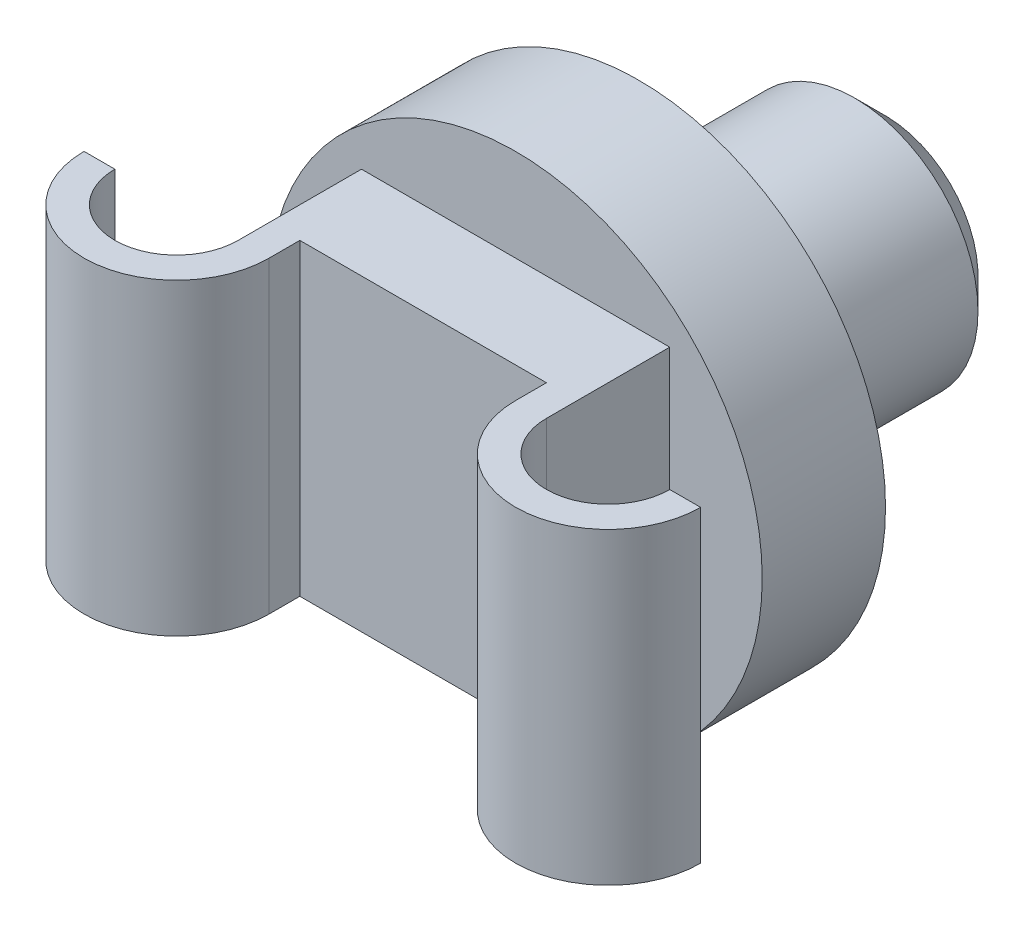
ISO-10303-21;
HEADER;
FILE_DESCRIPTION(('STEP AP214'),'2;1');
FILE_NAME('part.step','',(''),(''),'','','');
FILE_SCHEMA(('AUTOMOTIVE_DESIGN { 1 0 10303 214 1 1 1 1 }'));
ENDSEC;
DATA;
#1=APPLICATION_CONTEXT('core data for automotive mechanical design processes');
#2=APPLICATION_PROTOCOL_DEFINITION('international standard','automotive_design',2000,#1);
#3=PRODUCT_CONTEXT('',#1,'mechanical');
#4=PRODUCT('Part','Part','',(#3));
#5=PRODUCT_RELATED_PRODUCT_CATEGORY('part','',(#4));
#6=PRODUCT_DEFINITION_FORMATION('','',#4);
#7=PRODUCT_DEFINITION_CONTEXT('part definition',#1,'design');
#8=PRODUCT_DEFINITION('design','',#6,#7);
#9=PRODUCT_DEFINITION_SHAPE('','',#8);
#10=(LENGTH_UNIT() NAMED_UNIT(*) SI_UNIT(.MILLI.,.METRE.));
#11=(NAMED_UNIT(*) PLANE_ANGLE_UNIT() SI_UNIT($,.RADIAN.));
#12=(NAMED_UNIT(*) SI_UNIT($,.STERADIAN.) SOLID_ANGLE_UNIT());
#13=UNCERTAINTY_MEASURE_WITH_UNIT(LENGTH_MEASURE(1.E-05),#10,'distance_accuracy_value','');
#14=(GEOMETRIC_REPRESENTATION_CONTEXT(3) GLOBAL_UNCERTAINTY_ASSIGNED_CONTEXT((#13)) GLOBAL_UNIT_ASSIGNED_CONTEXT((#10,
#11,#12)) REPRESENTATION_CONTEXT('',''));
#15=CARTESIAN_POINT('',(0.,0.,0.));
#16=DIRECTION('',(0.,0.,1.));
#17=DIRECTION('',(1.,0.,0.));
#18=AXIS2_PLACEMENT_3D('',#15,#16,#17);
#19=CARTESIAN_POINT('',(0.,0.,0.));
#20=DIRECTION('',(0.,0.,1.));
#21=DIRECTION('',(1.,0.,0.));
#22=AXIS2_PLACEMENT_3D('',#19,#20,#21);
#23=PLANE('',#22);
#24=CARTESIAN_POINT('',(0.,0.,0.));
#25=DIRECTION('',(0.,0.,1.));
#26=DIRECTION('',(1.,0.,0.));
#27=AXIS2_PLACEMENT_3D('',#24,#25,#26);
#28=CIRCLE('',#27,4.);
#29=CARTESIAN_POINT('',(4.,0.,0.));
#30=VERTEX_POINT('',#29);
#31=EDGE_CURVE('E215',#30,#30,#28,.T.);
#32=ORIENTED_EDGE('',*,*,#31,.F.);
#33=EDGE_LOOP('',(#32));
#34=FACE_BOUND('',#33,.T.);
#35=CARTESIAN_POINT('',(0.,0.,0.));
#36=DIRECTION('',(0.,0.,1.));
#37=DIRECTION('',(1.,0.,0.));
#38=AXIS2_PLACEMENT_3D('',#35,#36,#37);
#39=CIRCLE('',#38,2.);
#40=CARTESIAN_POINT('',(2.,0.,0.));
#41=VERTEX_POINT('',#40);
#42=EDGE_CURVE('E229',#41,#41,#39,.F.);
#43=ORIENTED_EDGE('',*,*,#42,.F.);
#44=EDGE_LOOP('',(#43));
#45=FACE_BOUND('',#44,.T.);
#46=ADVANCED_FACE('F32',(#34,#45),#23,.F.);
#47=CARTESIAN_POINT('',(0.,0.,2.));
#48=DIRECTION('',(0.,0.,1.));
#49=DIRECTION('',(1.,0.,0.));
#50=AXIS2_PLACEMENT_3D('',#47,#48,#49);
#51=PLANE('',#50);
#52=CARTESIAN_POINT('',(0.,0.,2.));
#53=DIRECTION('',(0.,0.,1.));
#54=DIRECTION('',(1.,0.,0.));
#55=AXIS2_PLACEMENT_3D('',#52,#53,#54);
#56=CIRCLE('',#55,4.);
#57=CARTESIAN_POINT('',(4.,0.,2.));
#58=VERTEX_POINT('',#57);
#59=EDGE_CURVE('E218',#58,#58,#56,.T.);
#60=ORIENTED_EDGE('',*,*,#59,.T.);
#61=EDGE_LOOP('',(#60));
#62=FACE_BOUND('',#61,.T.);
#63=DIRECTION('',(1.,0.,0.));
#64=VECTOR('',#63,1.);
#65=CARTESIAN_POINT('',(-2.5,-2.5,2.));
#66=LINE('',#65,#64);
#67=CARTESIAN_POINT('',(-2.5,-2.5,2.));
#68=VERTEX_POINT('',#67);
#69=CARTESIAN_POINT('',(2.5,-2.5,2.));
#70=VERTEX_POINT('',#69);
#71=EDGE_CURVE('E198',#68,#70,#66,.T.);
#72=ORIENTED_EDGE('',*,*,#71,.F.);
#73=DIRECTION('',(0.,-1.,0.));
#74=VECTOR('',#73,1.);
#75=CARTESIAN_POINT('',(-2.5,2.5,2.));
#76=LINE('',#75,#74);
#77=CARTESIAN_POINT('',(-2.5,2.5,2.));
#78=VERTEX_POINT('',#77);
#79=EDGE_CURVE('E195',#78,#68,#76,.T.);
#80=ORIENTED_EDGE('',*,*,#79,.F.);
#81=DIRECTION('',(-1.,0.,0.));
#82=VECTOR('',#81,1.);
#83=CARTESIAN_POINT('',(-2.5,2.5,2.));
#84=LINE('',#83,#82);
#85=CARTESIAN_POINT('',(2.5,2.5,2.));
#86=VERTEX_POINT('',#85);
#87=EDGE_CURVE('E52',#86,#78,#84,.T.);
#88=ORIENTED_EDGE('',*,*,#87,.F.);
#89=DIRECTION('',(0.,1.,0.));
#90=VECTOR('',#89,1.);
#91=CARTESIAN_POINT('',(2.5,2.5,2.));
#92=LINE('',#91,#90);
#93=EDGE_CURVE('E200',#70,#86,#92,.T.);
#94=ORIENTED_EDGE('',*,*,#93,.F.);
#95=EDGE_LOOP('',(#72,#80,#88,#94));
#96=FACE_BOUND('',#95,.T.);
#97=ADVANCED_FACE('F247',(#62,#96),#51,.T.);
#98=CARTESIAN_POINT('',(0.,0.,2.));
#99=DIRECTION('',(0.,0.,-1.));
#100=DIRECTION('',(-1.,0.,0.));
#101=AXIS2_PLACEMENT_3D('',#98,#99,#100);
#102=CYLINDRICAL_SURFACE('',#101,4.);
#103=ORIENTED_EDGE('',*,*,#59,.F.);
#104=EDGE_LOOP('',(#103));
#105=FACE_BOUND('',#104,.T.);
#106=ORIENTED_EDGE('',*,*,#31,.T.);
#107=EDGE_LOOP('',(#106));
#108=FACE_BOUND('',#107,.T.);
#109=ADVANCED_FACE('F34',(#105,#108),#102,.T.);
#110=CARTESIAN_POINT('',(-2.5,2.5,4.));
#111=DIRECTION('',(1.,0.,0.));
#112=DIRECTION('',(0.,1.,0.));
#113=AXIS2_PLACEMENT_3D('',#110,#111,#112);
#114=PLANE('',#113);
#115=ORIENTED_EDGE('',*,*,#79,.T.);
#116=DIRECTION('',(0.,0.,-1.));
#117=VECTOR('',#116,1.);
#118=CARTESIAN_POINT('',(-2.5,-2.5,4.));
#119=LINE('',#118,#117);
#120=CARTESIAN_POINT('',(-2.5,-2.5,4.));
#121=VERTEX_POINT('',#120);
#122=EDGE_CURVE('E213',#121,#68,#119,.T.);
#123=ORIENTED_EDGE('',*,*,#122,.F.);
#124=DIRECTION('',(0.,-1.,0.));
#125=VECTOR('',#124,1.);
#126=CARTESIAN_POINT('',(-2.5,2.5,4.));
#127=LINE('',#126,#125);
#128=CARTESIAN_POINT('',(-2.5,2.5,4.));
#129=VERTEX_POINT('',#128);
#130=EDGE_CURVE('E203',#129,#121,#127,.T.);
#131=ORIENTED_EDGE('',*,*,#130,.F.);
#132=DIRECTION('',(0.,0.,-1.));
#133=VECTOR('',#132,1.);
#134=CARTESIAN_POINT('',(-2.5,2.5,4.));
#135=LINE('',#134,#133);
#136=EDGE_CURVE('E207',#129,#78,#135,.T.);
#137=ORIENTED_EDGE('',*,*,#136,.T.);
#138=EDGE_LOOP('',(#115,#123,#131,#137));
#139=FACE_BOUND('',#138,.T.);
#140=ADVANCED_FACE('F257',(#139),#114,.F.);
#141=CARTESIAN_POINT('',(-2.5,-2.5,4.));
#142=DIRECTION('',(0.,1.,0.));
#143=DIRECTION('',(-1.,0.,0.));
#144=AXIS2_PLACEMENT_3D('',#141,#142,#143);
#145=PLANE('',#144);
#146=DIRECTION('',(1.,0.,0.));
#147=VECTOR('',#146,1.);
#148=CARTESIAN_POINT('',(-2.,-2.5,3.5));
#149=LINE('',#148,#147);
#150=CARTESIAN_POINT('',(-2.,-2.5,3.5));
#151=VERTEX_POINT('',#150);
#152=CARTESIAN_POINT('',(2.,-2.5,3.5));
#153=VERTEX_POINT('',#152);
#154=EDGE_CURVE('E179',#151,#153,#149,.T.);
#155=ORIENTED_EDGE('',*,*,#154,.F.);
#156=DIRECTION('',(0.,0.,-1.));
#157=VECTOR('',#156,1.);
#158=CARTESIAN_POINT('',(-2.,-2.5,4.20003697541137));
#159=LINE('',#158,#157);
#160=CARTESIAN_POINT('',(-2.,-2.5,4.));
#161=VERTEX_POINT('',#160);
#162=EDGE_CURVE('E148',#161,#151,#159,.T.);
#163=ORIENTED_EDGE('',*,*,#162,.F.);
#164=CARTESIAN_POINT('',(-3.5,-2.5,4.));
#165=DIRECTION('',(0.,1.,0.));
#166=DIRECTION('',(-1.,0.,0.));
#167=AXIS2_PLACEMENT_3D('',#164,#165,#166);
#168=CIRCLE('',#167,1.5);
#169=CARTESIAN_POINT('',(-5.,-2.5,4.));
#170=VERTEX_POINT('',#169);
#171=EDGE_CURVE('E135',#170,#161,#168,.T.);
#172=ORIENTED_EDGE('',*,*,#171,.F.);
#173=DIRECTION('',(-1.,0.,0.));
#174=VECTOR('',#173,1.);
#175=CARTESIAN_POINT('',(-4.5,-2.5,4.));
#176=LINE('',#175,#174);
#177=CARTESIAN_POINT('',(-4.5,-2.5,4.));
#178=VERTEX_POINT('',#177);
#179=EDGE_CURVE('E123',#178,#170,#176,.T.);
#180=ORIENTED_EDGE('',*,*,#179,.F.);
#181=CARTESIAN_POINT('',(-3.5,-2.5,4.));
#182=DIRECTION('',(0.,-1.,0.));
#183=DIRECTION('',(-1.,0.,0.));
#184=AXIS2_PLACEMENT_3D('',#181,#182,#183);
#185=CIRCLE('',#184,1.);
#186=EDGE_CURVE('E134',#121,#178,#185,.T.);
#187=ORIENTED_EDGE('',*,*,#186,.F.);
#188=ORIENTED_EDGE('',*,*,#122,.T.);
#189=ORIENTED_EDGE('',*,*,#71,.T.);
#190=DIRECTION('',(0.,0.,-1.));
#191=VECTOR('',#190,1.);
#192=CARTESIAN_POINT('',(2.5,-2.5,4.));
#193=LINE('',#192,#191);
#194=CARTESIAN_POINT('',(2.5,-2.5,4.));
#195=VERTEX_POINT('',#194);
#196=EDGE_CURVE('E210',#195,#70,#193,.T.);
#197=ORIENTED_EDGE('',*,*,#196,.F.);
#198=CARTESIAN_POINT('',(3.5,-2.5,4.));
#199=DIRECTION('',(0.,1.,0.));
#200=DIRECTION('',(1.,0.,0.));
#201=AXIS2_PLACEMENT_3D('',#198,#199,#200);
#202=CIRCLE('',#201,1.);
#203=CARTESIAN_POINT('',(4.5,-2.5,4.));
#204=VERTEX_POINT('',#203);
#205=EDGE_CURVE('E160',#195,#204,#202,.T.);
#206=ORIENTED_EDGE('',*,*,#205,.T.);
#207=DIRECTION('',(1.,0.,0.));
#208=VECTOR('',#207,1.);
#209=CARTESIAN_POINT('',(4.5,-2.5,4.));
#210=LINE('',#209,#208);
#211=CARTESIAN_POINT('',(5.,-2.5,4.));
#212=VERTEX_POINT('',#211);
#213=EDGE_CURVE('E163',#204,#212,#210,.T.);
#214=ORIENTED_EDGE('',*,*,#213,.T.);
#215=CARTESIAN_POINT('',(3.5,-2.5,4.));
#216=DIRECTION('',(0.,-1.,0.));
#217=DIRECTION('',(1.,0.,0.));
#218=AXIS2_PLACEMENT_3D('',#215,#216,#217);
#219=CIRCLE('',#218,1.5);
#220=CARTESIAN_POINT('',(2.,-2.5,4.));
#221=VERTEX_POINT('',#220);
#222=EDGE_CURVE('E156',#212,#221,#219,.T.);
#223=ORIENTED_EDGE('',*,*,#222,.T.);
#224=DIRECTION('',(0.,0.,1.));
#225=VECTOR('',#224,1.);
#226=CARTESIAN_POINT('',(2.,-2.5,4.20003697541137));
#227=LINE('',#226,#225);
#228=EDGE_CURVE('E182',#153,#221,#227,.T.);
#229=ORIENTED_EDGE('',*,*,#228,.F.);
#230=EDGE_LOOP('',(#155,#163,#172,#180,#187,#188,#189,#197,#206,#214,#223,#229));
#231=FACE_BOUND('',#230,.T.);
#232=ADVANCED_FACE('F146',(#231),#145,.F.);
#233=CARTESIAN_POINT('',(2.5,2.5,4.));
#234=DIRECTION('',(-1.,0.,0.));
#235=DIRECTION('',(0.,-1.,0.));
#236=AXIS2_PLACEMENT_3D('',#233,#234,#235);
#237=PLANE('',#236);
#238=ORIENTED_EDGE('',*,*,#93,.T.);
#239=DIRECTION('',(0.,0.,-1.));
#240=VECTOR('',#239,1.);
#241=CARTESIAN_POINT('',(2.5,2.5,4.));
#242=LINE('',#241,#240);
#243=CARTESIAN_POINT('',(2.5,2.5,4.));
#244=VERTEX_POINT('',#243);
#245=EDGE_CURVE('E47',#244,#86,#242,.T.);
#246=ORIENTED_EDGE('',*,*,#245,.F.);
#247=DIRECTION('',(0.,1.,0.));
#248=VECTOR('',#247,1.);
#249=CARTESIAN_POINT('',(2.5,2.5,4.));
#250=LINE('',#249,#248);
#251=EDGE_CURVE('E205',#195,#244,#250,.T.);
#252=ORIENTED_EDGE('',*,*,#251,.F.);
#253=ORIENTED_EDGE('',*,*,#196,.T.);
#254=EDGE_LOOP('',(#238,#246,#252,#253));
#255=FACE_BOUND('',#254,.T.);
#256=ADVANCED_FACE('F263',(#255),#237,.F.);
#257=CARTESIAN_POINT('',(-2.5,2.5,4.));
#258=DIRECTION('',(0.,-1.,0.));
#259=DIRECTION('',(1.,0.,0.));
#260=AXIS2_PLACEMENT_3D('',#257,#258,#259);
#261=PLANE('',#260);
#262=ORIENTED_EDGE('',*,*,#136,.F.);
#263=CARTESIAN_POINT('',(-3.5,2.5,4.));
#264=DIRECTION('',(0.,-1.,0.));
#265=DIRECTION('',(-1.,0.,0.));
#266=AXIS2_PLACEMENT_3D('',#263,#264,#265);
#267=CIRCLE('',#266,1.);
#268=CARTESIAN_POINT('',(-4.5,2.5,4.));
#269=VERTEX_POINT('',#268);
#270=EDGE_CURVE('E142',#129,#269,#267,.T.);
#271=ORIENTED_EDGE('',*,*,#270,.T.);
#272=DIRECTION('',(-1.,0.,0.));
#273=VECTOR('',#272,1.);
#274=CARTESIAN_POINT('',(-4.5,2.5,4.));
#275=LINE('',#274,#273);
#276=CARTESIAN_POINT('',(-5.,2.5,4.));
#277=VERTEX_POINT('',#276);
#278=EDGE_CURVE('E153',#269,#277,#275,.T.);
#279=ORIENTED_EDGE('',*,*,#278,.T.);
#280=CARTESIAN_POINT('',(-3.5,2.5,4.));
#281=DIRECTION('',(0.,1.,0.));
#282=DIRECTION('',(-1.,0.,0.));
#283=AXIS2_PLACEMENT_3D('',#280,#281,#282);
#284=CIRCLE('',#283,1.5);
#285=CARTESIAN_POINT('',(-2.,2.5,4.));
#286=VERTEX_POINT('',#285);
#287=EDGE_CURVE('E141',#277,#286,#284,.T.);
#288=ORIENTED_EDGE('',*,*,#287,.T.);
#289=DIRECTION('',(0.,0.,-1.));
#290=VECTOR('',#289,1.);
#291=CARTESIAN_POINT('',(-2.,2.5,4.));
#292=LINE('',#291,#290);
#293=CARTESIAN_POINT('',(-2.,2.5,3.5));
#294=VERTEX_POINT('',#293);
#295=EDGE_CURVE('E192',#286,#294,#292,.T.);
#296=ORIENTED_EDGE('',*,*,#295,.T.);
#297=DIRECTION('',(1.,0.,0.));
#298=VECTOR('',#297,1.);
#299=CARTESIAN_POINT('',(-2.5,2.5,3.5));
#300=LINE('',#299,#298);
#301=CARTESIAN_POINT('',(2.,2.5,3.5));
#302=VERTEX_POINT('',#301);
#303=EDGE_CURVE('E226',#294,#302,#300,.T.);
#304=ORIENTED_EDGE('',*,*,#303,.T.);
#305=DIRECTION('',(0.,0.,1.));
#306=VECTOR('',#305,1.);
#307=CARTESIAN_POINT('',(2.,2.5,4.));
#308=LINE('',#307,#306);
#309=CARTESIAN_POINT('',(2.,2.5,4.));
#310=VERTEX_POINT('',#309);
#311=EDGE_CURVE('E188',#302,#310,#308,.T.);
#312=ORIENTED_EDGE('',*,*,#311,.T.);
#313=CARTESIAN_POINT('',(3.5,2.5,4.));
#314=DIRECTION('',(0.,-1.,0.));
#315=DIRECTION('',(1.,0.,0.));
#316=AXIS2_PLACEMENT_3D('',#313,#314,#315);
#317=CIRCLE('',#316,1.5);
#318=CARTESIAN_POINT('',(5.,2.5,4.));
#319=VERTEX_POINT('',#318);
#320=EDGE_CURVE('E166',#319,#310,#317,.T.);
#321=ORIENTED_EDGE('',*,*,#320,.F.);
#322=DIRECTION('',(1.,0.,0.));
#323=VECTOR('',#322,1.);
#324=CARTESIAN_POINT('',(4.5,2.5,4.));
#325=LINE('',#324,#323);
#326=CARTESIAN_POINT('',(4.5,2.5,4.));
#327=VERTEX_POINT('',#326);
#328=EDGE_CURVE('E171',#327,#319,#325,.T.);
#329=ORIENTED_EDGE('',*,*,#328,.F.);
#330=CARTESIAN_POINT('',(3.5,2.5,4.));
#331=DIRECTION('',(0.,1.,0.));
#332=DIRECTION('',(1.,0.,0.));
#333=AXIS2_PLACEMENT_3D('',#330,#331,#332);
#334=CIRCLE('',#333,1.);
#335=EDGE_CURVE('E168',#244,#327,#334,.T.);
#336=ORIENTED_EDGE('',*,*,#335,.F.);
#337=ORIENTED_EDGE('',*,*,#245,.T.);
#338=ORIENTED_EDGE('',*,*,#87,.T.);
#339=EDGE_LOOP('',(#262,#271,#279,#288,#296,#304,#312,#321,#329,#336,#337,#338));
#340=FACE_BOUND('',#339,.T.);
#341=ADVANCED_FACE('F266',(#340),#261,.F.);
#342=CARTESIAN_POINT('',(-2.,4.,3.5));
#343=DIRECTION('',(0.,0.,-1.));
#344=DIRECTION('',(-1.,0.,0.));
#345=AXIS2_PLACEMENT_3D('',#342,#343,#344);
#346=PLANE('',#345);
#347=DIRECTION('',(0.,-1.,0.));
#348=VECTOR('',#347,1.);
#349=CARTESIAN_POINT('',(-2.,4.,3.5));
#350=LINE('',#349,#348);
#351=EDGE_CURVE('E185',#294,#151,#350,.T.);
#352=ORIENTED_EDGE('',*,*,#351,.T.);
#353=ORIENTED_EDGE('',*,*,#154,.T.);
#354=DIRECTION('',(0.,-1.,0.));
#355=VECTOR('',#354,1.);
#356=CARTESIAN_POINT('',(2.,4.,3.5));
#357=LINE('',#356,#355);
#358=EDGE_CURVE('E186',#302,#153,#357,.T.);
#359=ORIENTED_EDGE('',*,*,#358,.F.);
#360=ORIENTED_EDGE('',*,*,#303,.F.);
#361=EDGE_LOOP('',(#352,#353,#359,#360));
#362=FACE_BOUND('',#361,.T.);
#363=ADVANCED_FACE('F270',(#362),#346,.F.);
#364=CARTESIAN_POINT('',(-2.,4.,4.20003697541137));
#365=DIRECTION('',(-1.,0.,0.));
#366=DIRECTION('',(0.,0.,1.));
#367=AXIS2_PLACEMENT_3D('',#364,#365,#366);
#368=PLANE('',#367);
#369=DIRECTION('',(0.,-1.,0.));
#370=VECTOR('',#369,1.);
#371=CARTESIAN_POINT('',(-2.,2.5,4.));
#372=LINE('',#371,#370);
#373=EDGE_CURVE('E224',#286,#161,#372,.T.);
#374=ORIENTED_EDGE('',*,*,#373,.T.);
#375=ORIENTED_EDGE('',*,*,#162,.T.);
#376=ORIENTED_EDGE('',*,*,#351,.F.);
#377=ORIENTED_EDGE('',*,*,#295,.F.);
#378=EDGE_LOOP('',(#374,#375,#376,#377));
#379=FACE_BOUND('',#378,.T.);
#380=ADVANCED_FACE('F271',(#379),#368,.F.);
#381=CARTESIAN_POINT('',(2.,4.,4.20003697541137));
#382=DIRECTION('',(1.,0.,0.));
#383=DIRECTION('',(0.,1.,0.));
#384=AXIS2_PLACEMENT_3D('',#381,#382,#383);
#385=PLANE('',#384);
#386=ORIENTED_EDGE('',*,*,#358,.T.);
#387=ORIENTED_EDGE('',*,*,#228,.T.);
#388=DIRECTION('',(0.,1.,0.));
#389=VECTOR('',#388,1.);
#390=CARTESIAN_POINT('',(2.,2.5,4.));
#391=LINE('',#390,#389);
#392=EDGE_CURVE('E221',#221,#310,#391,.T.);
#393=ORIENTED_EDGE('',*,*,#392,.T.);
#394=ORIENTED_EDGE('',*,*,#311,.F.);
#395=EDGE_LOOP('',(#386,#387,#393,#394));
#396=FACE_BOUND('',#395,.T.);
#397=ADVANCED_FACE('F274',(#396),#385,.F.);
#398=CARTESIAN_POINT('',(3.5,2.5,4.));
#399=DIRECTION('',(0.,-1.,0.));
#400=DIRECTION('',(1.,0.,0.));
#401=AXIS2_PLACEMENT_3D('',#398,#399,#400);
#402=CYLINDRICAL_SURFACE('',#401,1.5);
#403=ORIENTED_EDGE('',*,*,#222,.F.);
#404=DIRECTION('',(0.,-1.,0.));
#405=VECTOR('',#404,1.);
#406=CARTESIAN_POINT('',(5.,2.5,4.));
#407=LINE('',#406,#405);
#408=EDGE_CURVE('E175',#319,#212,#407,.T.);
#409=ORIENTED_EDGE('',*,*,#408,.F.);
#410=ORIENTED_EDGE('',*,*,#320,.T.);
#411=ORIENTED_EDGE('',*,*,#392,.F.);
#412=EDGE_LOOP('',(#403,#409,#410,#411));
#413=FACE_BOUND('',#412,.T.);
#414=ADVANCED_FACE('F281',(#413),#402,.T.);
#415=CARTESIAN_POINT('',(4.5,2.5,4.));
#416=DIRECTION('',(0.,0.,-1.));
#417=DIRECTION('',(-1.,0.,0.));
#418=AXIS2_PLACEMENT_3D('',#415,#416,#417);
#419=PLANE('',#418);
#420=ORIENTED_EDGE('',*,*,#213,.F.);
#421=DIRECTION('',(0.,-1.,0.));
#422=VECTOR('',#421,1.);
#423=CARTESIAN_POINT('',(4.5,2.5,4.));
#424=LINE('',#423,#422);
#425=EDGE_CURVE('E174',#327,#204,#424,.T.);
#426=ORIENTED_EDGE('',*,*,#425,.F.);
#427=ORIENTED_EDGE('',*,*,#328,.T.);
#428=ORIENTED_EDGE('',*,*,#408,.T.);
#429=EDGE_LOOP('',(#420,#426,#427,#428));
#430=FACE_BOUND('',#429,.T.);
#431=ADVANCED_FACE('F285',(#430),#419,.T.);
#432=CARTESIAN_POINT('',(3.5,2.5,4.));
#433=DIRECTION('',(0.,-1.,0.));
#434=DIRECTION('',(1.,0.,0.));
#435=AXIS2_PLACEMENT_3D('',#432,#433,#434);
#436=CYLINDRICAL_SURFACE('',#435,1.);
#437=ORIENTED_EDGE('',*,*,#205,.F.);
#438=ORIENTED_EDGE('',*,*,#251,.T.);
#439=ORIENTED_EDGE('',*,*,#335,.T.);
#440=ORIENTED_EDGE('',*,*,#425,.T.);
#441=EDGE_LOOP('',(#437,#438,#439,#440));
#442=FACE_BOUND('',#441,.T.);
#443=ADVANCED_FACE('F287',(#442),#436,.F.);
#444=CARTESIAN_POINT('',(-3.5,2.5,4.));
#445=DIRECTION('',(0.,-1.,0.));
#446=DIRECTION('',(1.,0.,0.));
#447=AXIS2_PLACEMENT_3D('',#444,#445,#446);
#448=CYLINDRICAL_SURFACE('',#447,1.5);
#449=ORIENTED_EDGE('',*,*,#171,.T.);
#450=ORIENTED_EDGE('',*,*,#373,.F.);
#451=ORIENTED_EDGE('',*,*,#287,.F.);
#452=DIRECTION('',(0.,-1.,0.));
#453=VECTOR('',#452,1.);
#454=CARTESIAN_POINT('',(-5.,2.5,4.));
#455=LINE('',#454,#453);
#456=EDGE_CURVE('E127',#277,#170,#455,.T.);
#457=ORIENTED_EDGE('',*,*,#456,.T.);
#458=EDGE_LOOP('',(#449,#450,#451,#457));
#459=FACE_BOUND('',#458,.T.);
#460=ADVANCED_FACE('F138',(#459),#448,.T.);
#461=CARTESIAN_POINT('',(-3.5,2.5,4.));
#462=DIRECTION('',(0.,-1.,0.));
#463=DIRECTION('',(1.,0.,0.));
#464=AXIS2_PLACEMENT_3D('',#461,#462,#463);
#465=CYLINDRICAL_SURFACE('',#464,1.);
#466=ORIENTED_EDGE('',*,*,#186,.T.);
#467=DIRECTION('',(0.,-1.,0.));
#468=VECTOR('',#467,1.);
#469=CARTESIAN_POINT('',(-4.5,2.5,4.));
#470=LINE('',#469,#468);
#471=EDGE_CURVE('E130',#269,#178,#470,.T.);
#472=ORIENTED_EDGE('',*,*,#471,.F.);
#473=ORIENTED_EDGE('',*,*,#270,.F.);
#474=ORIENTED_EDGE('',*,*,#130,.T.);
#475=EDGE_LOOP('',(#466,#472,#473,#474));
#476=FACE_BOUND('',#475,.T.);
#477=ADVANCED_FACE('F296',(#476),#465,.F.);
#478=CARTESIAN_POINT('',(-4.5,2.5,4.));
#479=DIRECTION('',(0.,0.,1.));
#480=DIRECTION('',(1.,0.,0.));
#481=AXIS2_PLACEMENT_3D('',#478,#479,#480);
#482=PLANE('',#481);
#483=ORIENTED_EDGE('',*,*,#179,.T.);
#484=ORIENTED_EDGE('',*,*,#456,.F.);
#485=ORIENTED_EDGE('',*,*,#278,.F.);
#486=ORIENTED_EDGE('',*,*,#471,.T.);
#487=EDGE_LOOP('',(#483,#484,#485,#486));
#488=FACE_BOUND('',#487,.T.);
#489=ADVANCED_FACE('F125',(#488),#482,.F.);
#490=CARTESIAN_POINT('',(0.,0.,-4.));
#491=DIRECTION('',(0.,0.,1.));
#492=DIRECTION('',(1.,0.,0.));
#493=AXIS2_PLACEMENT_3D('',#490,#491,#492);
#494=CYLINDRICAL_SURFACE('',#493,2.);
#495=CARTESIAN_POINT('',(0.,0.,-3.5));
#496=DIRECTION('',(0.,0.,-1.));
#497=DIRECTION('',(-1.,0.,0.));
#498=AXIS2_PLACEMENT_3D('',#495,#496,#497);
#499=CIRCLE('',#498,2.);
#500=CARTESIAN_POINT('',(-2.,0.,-3.5));
#501=VERTEX_POINT('',#500);
#502=EDGE_CURVE('E11',#501,#501,#499,.F.);
#503=ORIENTED_EDGE('',*,*,#502,.T.);
#504=EDGE_LOOP('',(#503));
#505=FACE_BOUND('',#504,.T.);
#506=ORIENTED_EDGE('',*,*,#42,.T.);
#507=EDGE_LOOP('',(#506));
#508=FACE_BOUND('',#507,.T.);
#509=ADVANCED_FACE('F243',(#505,#508),#494,.T.);
#510=CARTESIAN_POINT('',(0.,0.,-4.));
#511=DIRECTION('',(0.,0.,-1.));
#512=DIRECTION('',(-1.,0.,0.));
#513=AXIS2_PLACEMENT_3D('',#510,#511,#512);
#514=PLANE('',#513);
#515=CARTESIAN_POINT('',(0.,0.,-4.));
#516=DIRECTION('',(0.,0.,-1.));
#517=DIRECTION('',(-1.,0.,0.));
#518=AXIS2_PLACEMENT_3D('',#515,#516,#517);
#519=CIRCLE('',#518,1.5);
#520=CARTESIAN_POINT('',(-1.5,0.,-4.));
#521=VERTEX_POINT('',#520);
#522=EDGE_CURVE('E40',#521,#521,#519,.T.);
#523=ORIENTED_EDGE('',*,*,#522,.T.);
#524=EDGE_LOOP('',(#523));
#525=FACE_BOUND('',#524,.T.);
#526=ADVANCED_FACE('F234',(#525),#514,.T.);
#527=CARTESIAN_POINT('',(0.,0.,-4.));
#528=DIRECTION('',(0.,0.,1.));
#529=DIRECTION('',(1.,0.,0.));
#530=AXIS2_PLACEMENT_3D('',#527,#528,#529);
#531=CONICAL_SURFACE('',#530,1.5,0.785398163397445);
#532=ORIENTED_EDGE('',*,*,#502,.F.);
#533=EDGE_LOOP('',(#532));
#534=FACE_BOUND('',#533,.T.);
#535=ORIENTED_EDGE('',*,*,#522,.F.);
#536=EDGE_LOOP('',(#535));
#537=FACE_BOUND('',#536,.T.);
#538=ADVANCED_FACE('F236',(#534,#537),#531,.T.);
#539=CLOSED_SHELL('',(#46,#97,#109,#140,#232,#256,#341,#363,#380,#397,#414,#431,#443,#460,#477,
#489,#509,#526,#538));
#540=MANIFOLD_SOLID_BREP('B2',#539);
#541=ADVANCED_BREP_SHAPE_REPRESENTATION('',(#18,#540),#14);
#542=SHAPE_DEFINITION_REPRESENTATION(#9,#541);
ENDSEC;
END-ISO-10303-21;
